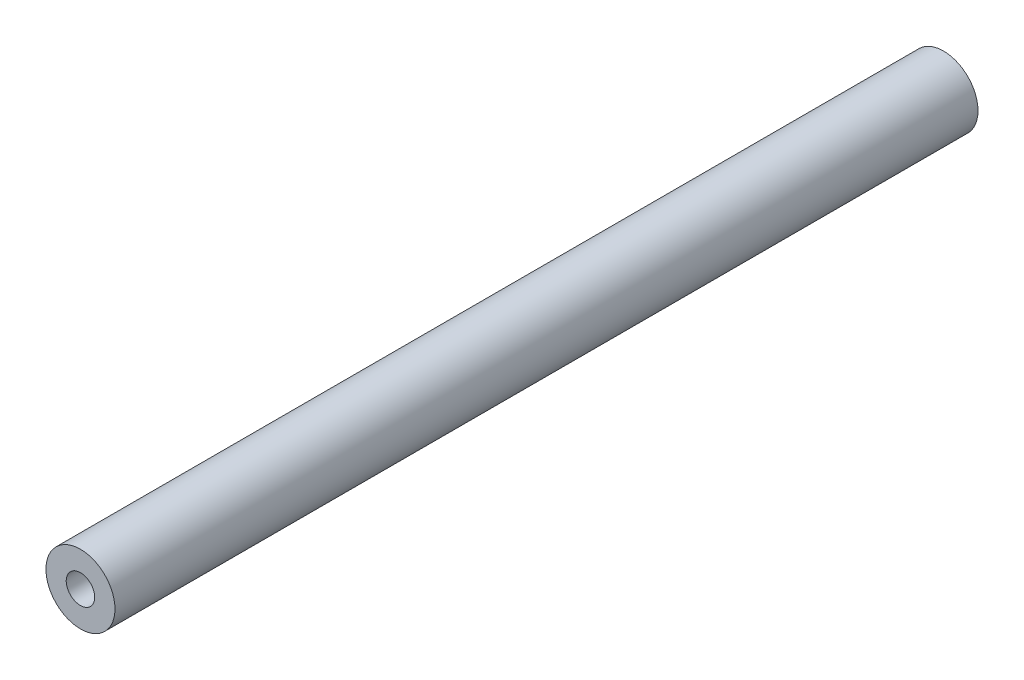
ISO-10303-21;
HEADER;
FILE_DESCRIPTION(('STEP AP214'),'2;1');
FILE_NAME('part.step','',(''),(''),'','','');
FILE_SCHEMA(('AUTOMOTIVE_DESIGN { 1 0 10303 214 1 1 1 1 }'));
ENDSEC;
DATA;
#1=APPLICATION_CONTEXT('core data for automotive mechanical design processes');
#2=APPLICATION_PROTOCOL_DEFINITION('international standard','automotive_design',2000,#1);
#3=PRODUCT_CONTEXT('',#1,'mechanical');
#4=PRODUCT('Part','Part','',(#3));
#5=PRODUCT_RELATED_PRODUCT_CATEGORY('part','',(#4));
#6=PRODUCT_DEFINITION_FORMATION('','',#4);
#7=PRODUCT_DEFINITION_CONTEXT('part definition',#1,'design');
#8=PRODUCT_DEFINITION('design','',#6,#7);
#9=PRODUCT_DEFINITION_SHAPE('','',#8);
#10=(LENGTH_UNIT() NAMED_UNIT(*) SI_UNIT(.MILLI.,.METRE.));
#11=(NAMED_UNIT(*) PLANE_ANGLE_UNIT() SI_UNIT($,.RADIAN.));
#12=(NAMED_UNIT(*) SI_UNIT($,.STERADIAN.) SOLID_ANGLE_UNIT());
#13=UNCERTAINTY_MEASURE_WITH_UNIT(LENGTH_MEASURE(1.E-05),#10,'distance_accuracy_value','');
#14=(GEOMETRIC_REPRESENTATION_CONTEXT(3) GLOBAL_UNCERTAINTY_ASSIGNED_CONTEXT((#13)) GLOBAL_UNIT_ASSIGNED_CONTEXT((#10,
#11,#12)) REPRESENTATION_CONTEXT('',''));
#15=CARTESIAN_POINT('',(0.,0.,0.));
#16=DIRECTION('',(0.,0.,1.));
#17=DIRECTION('',(1.,0.,0.));
#18=AXIS2_PLACEMENT_3D('',#15,#16,#17);
#19=CARTESIAN_POINT('',(0.,0.,0.));
#20=DIRECTION('',(0.,0.,1.));
#21=DIRECTION('',(1.,0.,0.));
#22=AXIS2_PLACEMENT_3D('',#19,#20,#21);
#23=PLANE('',#22);
#24=CARTESIAN_POINT('',(0.,0.,0.));
#25=DIRECTION('',(0.,0.,-1.));
#26=DIRECTION('',(-1.,0.,0.));
#27=AXIS2_PLACEMENT_3D('',#24,#25,#26);
#28=CIRCLE('',#27,1.65);
#29=CARTESIAN_POINT('',(-1.65,0.,0.));
#30=VERTEX_POINT('',#29);
#31=EDGE_CURVE('E69',#30,#30,#28,.T.);
#32=ORIENTED_EDGE('',*,*,#31,.F.);
#33=EDGE_LOOP('',(#32));
#34=FACE_BOUND('',#33,.T.);
#35=CARTESIAN_POINT('',(0.,0.,0.));
#36=DIRECTION('',(0.,0.,1.));
#37=DIRECTION('',(1.,0.,0.));
#38=AXIS2_PLACEMENT_3D('',#35,#36,#37);
#39=CIRCLE('',#38,4.);
#40=CARTESIAN_POINT('',(4.,0.,0.));
#41=VERTEX_POINT('',#40);
#42=EDGE_CURVE('E11',#41,#41,#39,.T.);
#43=ORIENTED_EDGE('',*,*,#42,.F.);
#44=EDGE_LOOP('',(#43));
#45=FACE_BOUND('',#44,.T.);
#46=ADVANCED_FACE('F17',(#34,#45),#23,.F.);
#47=CARTESIAN_POINT('',(0.,0.,100.));
#48=DIRECTION('',(0.,0.,1.));
#49=DIRECTION('',(1.,0.,0.));
#50=AXIS2_PLACEMENT_3D('',#47,#48,#49);
#51=PLANE('',#50);
#52=CARTESIAN_POINT('',(0.,0.,100.));
#53=DIRECTION('',(0.,0.,1.));
#54=DIRECTION('',(1.,0.,0.));
#55=AXIS2_PLACEMENT_3D('',#52,#53,#54);
#56=CIRCLE('',#55,1.65);
#57=CARTESIAN_POINT('',(1.65,0.,100.));
#58=VERTEX_POINT('',#57);
#59=EDGE_CURVE('E78',#58,#58,#56,.T.);
#60=ORIENTED_EDGE('',*,*,#59,.F.);
#61=EDGE_LOOP('',(#60));
#62=FACE_BOUND('',#61,.T.);
#63=CARTESIAN_POINT('',(0.,0.,100.));
#64=DIRECTION('',(0.,0.,1.));
#65=DIRECTION('',(1.,0.,0.));
#66=AXIS2_PLACEMENT_3D('',#63,#64,#65);
#67=CIRCLE('',#66,4.);
#68=CARTESIAN_POINT('',(4.,0.,100.));
#69=VERTEX_POINT('',#68);
#70=EDGE_CURVE('E25',#69,#69,#67,.T.);
#71=ORIENTED_EDGE('',*,*,#70,.T.);
#72=EDGE_LOOP('',(#71));
#73=FACE_BOUND('',#72,.T.);
#74=ADVANCED_FACE('F59',(#62,#73),#51,.T.);
#75=CARTESIAN_POINT('',(0.,0.,100.));
#76=DIRECTION('',(0.,0.,-1.));
#77=DIRECTION('',(-1.,0.,0.));
#78=AXIS2_PLACEMENT_3D('',#75,#76,#77);
#79=CYLINDRICAL_SURFACE('',#78,4.);
#80=ORIENTED_EDGE('',*,*,#42,.T.);
#81=EDGE_LOOP('',(#80));
#82=FACE_BOUND('',#81,.T.);
#83=ORIENTED_EDGE('',*,*,#70,.F.);
#84=EDGE_LOOP('',(#83));
#85=FACE_BOUND('',#84,.T.);
#86=ADVANCED_FACE('F64',(#82,#85),#79,.T.);
#87=CARTESIAN_POINT('',(0.,0.,89.9));
#88=DIRECTION('',(0.,0.,1.));
#89=DIRECTION('',(1.,0.,0.));
#90=AXIS2_PLACEMENT_3D('',#87,#88,#89);
#91=CONICAL_SURFACE('',#90,1.65,1.02974425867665);
#92=CARTESIAN_POINT('',(0.,0.,89.9));
#93=DIRECTION('',(0.,0.,1.));
#94=DIRECTION('',(1.,0.,0.));
#95=AXIS2_PLACEMENT_3D('',#92,#93,#94);
#96=CIRCLE('',#95,1.65);
#97=CARTESIAN_POINT('',(1.65,0.,89.9));
#98=VERTEX_POINT('',#97);
#99=EDGE_CURVE('E83',#98,#98,#96,.T.);
#100=ORIENTED_EDGE('',*,*,#99,.T.);
#101=EDGE_LOOP('',(#100));
#102=FACE_BOUND('',#101,.T.);
#103=CARTESIAN_POINT('',(0.,0.,88.9085799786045));
#104=VERTEX_POINT('',#103);
#105=VERTEX_LOOP('',#104);
#106=FACE_BOUND('',#105,.T.);
#107=ADVANCED_FACE('F53',(#102,#106),#91,.F.);
#108=CARTESIAN_POINT('',(0.,0.,100.));
#109=DIRECTION('',(0.,0.,1.));
#110=DIRECTION('',(1.,0.,0.));
#111=AXIS2_PLACEMENT_3D('',#108,#109,#110);
#112=CYLINDRICAL_SURFACE('',#111,1.65);
#113=ORIENTED_EDGE('',*,*,#59,.T.);
#114=EDGE_LOOP('',(#113));
#115=FACE_BOUND('',#114,.T.);
#116=ORIENTED_EDGE('',*,*,#99,.F.);
#117=EDGE_LOOP('',(#116));
#118=FACE_BOUND('',#117,.T.);
#119=ADVANCED_FACE('F43',(#115,#118),#112,.F.);
#120=CARTESIAN_POINT('',(0.,0.,10.1));
#121=DIRECTION('',(0.,0.,-1.));
#122=DIRECTION('',(-1.,0.,0.));
#123=AXIS2_PLACEMENT_3D('',#120,#121,#122);
#124=CONICAL_SURFACE('',#123,1.65,1.02974425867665);
#125=CARTESIAN_POINT('',(0.,0.,10.1));
#126=DIRECTION('',(0.,0.,-1.));
#127=DIRECTION('',(-1.,0.,0.));
#128=AXIS2_PLACEMENT_3D('',#125,#126,#127);
#129=CIRCLE('',#128,1.65);
#130=CARTESIAN_POINT('',(-1.65,0.,10.1));
#131=VERTEX_POINT('',#130);
#132=EDGE_CURVE('E91',#131,#131,#129,.T.);
#133=ORIENTED_EDGE('',*,*,#132,.T.);
#134=EDGE_LOOP('',(#133));
#135=FACE_BOUND('',#134,.T.);
#136=CARTESIAN_POINT('',(0.,0.,11.0914200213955));
#137=VERTEX_POINT('',#136);
#138=VERTEX_LOOP('',#137);
#139=FACE_BOUND('',#138,.T.);
#140=ADVANCED_FACE('F40',(#135,#139),#124,.F.);
#141=CARTESIAN_POINT('',(0.,0.,0.));
#142=DIRECTION('',(0.,0.,-1.));
#143=DIRECTION('',(-1.,0.,0.));
#144=AXIS2_PLACEMENT_3D('',#141,#142,#143);
#145=CYLINDRICAL_SURFACE('',#144,1.65);
#146=ORIENTED_EDGE('',*,*,#31,.T.);
#147=EDGE_LOOP('',(#146));
#148=FACE_BOUND('',#147,.T.);
#149=ORIENTED_EDGE('',*,*,#132,.F.);
#150=EDGE_LOOP('',(#149));
#151=FACE_BOUND('',#150,.T.);
#152=ADVANCED_FACE('F42',(#148,#151),#145,.F.);
#153=CLOSED_SHELL('',(#46,#74,#86,#107,#119,#140,#152));
#154=MANIFOLD_SOLID_BREP('B1',#153);
#155=ADVANCED_BREP_SHAPE_REPRESENTATION('',(#18,#154),#14);
#156=SHAPE_DEFINITION_REPRESENTATION(#9,#155);
ENDSEC;
END-ISO-10303-21;
